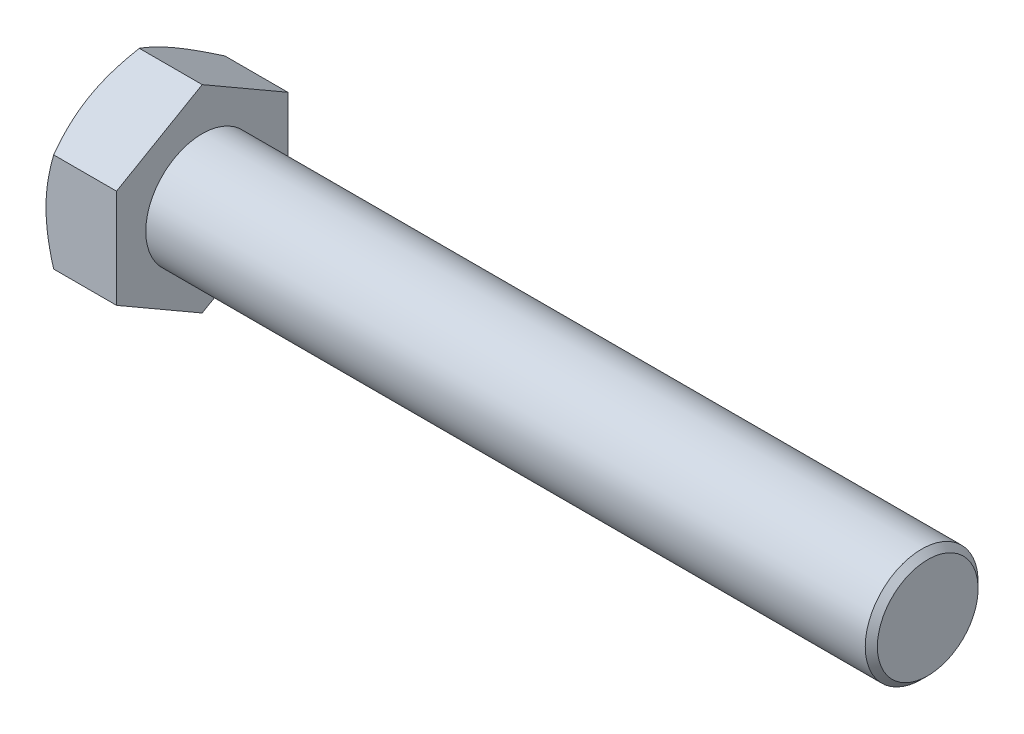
from build123d import *

# Parameters (mm, degrees)
BASEHEAD_DEPTH = 35


with BuildPart() as part:
    # BaseHeadSke → BaseHead (new body)
    with BuildSketch(Plane(origin=(0, 0, 0), x_dir=(0, 0, -1), z_dir=(1, 0, 0))):
        Polygon((0, 49.074772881), (-42.5, 24.537386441), (-42.5, -24.537386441), (0, -49.074772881), (42.5, -24.537386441), (42.5, 24.537386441), align=None)
    extrude(amount=BASEHEAD_DEPTH)

    # HeadChamferSke → HeadChamfer (revolve, cut)
    with BuildSketch(Plane.XY):
        Polygon((0, 49.074772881), (0, 42.5), (3.795946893, 49.074772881), align=None)
    revolve(axis=Axis((0, 0, 0), (1, 0, 0)), mode=Mode.SUBTRACT)

    # BodySke → BaseBody (revolve)
    with BuildSketch(Plane.XY, mode=Mode.PRIVATE) as basebody_sk:
        Polygon((0, 0), (0, 28), (391.9855, 28), (395, 24.9855), (395, 0), align=None)
    revolve(basebody_sk.sketch.rotate(Axis((0, 0, 0), (1, 0, 0)), 90), axis=Axis((0, 0, 0), (1, 0, 0)))


solid = part.part
